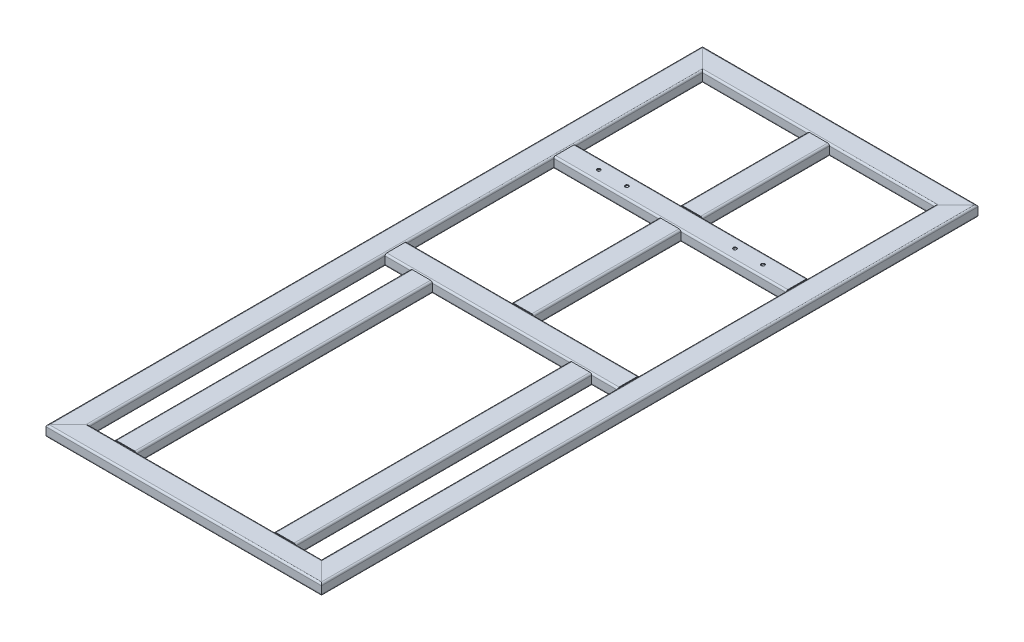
from build123d import *

# Parameters (mm, degrees)
TUBO_RETTANGOLARE_80_X_40_X_3_0_1_DEPTH      = 2395.72135955
TUBO_RETTANGOLARE_80_X_40_X_3_0_1_DEPTH_BACK = 45.72135955
TUBO_RETTANGOLARE_80_X_40_X_3_0_1_2_DEPTH    = 1031.4427191
TUBO_RETTANGOLARE_80_X_40_X_3_0_1_3_DEPTH    = 2441.4427191
TUBO_RETTANGOLARE_80_X_40_X_3_0_1_4_DEPTH    = 1031.4427191
TUBO_RETTANGOLARE_80_X_40_X_3_0_2_DEPTH      = 940
TUBO_RETTANGOLARE_80_X_40_X_3_0_2_2_DEPTH    = 940
TUBO_RETTANGOLARE_80_X_40_X_3_0_3_DEPTH      = 1175
TUBO_RETTANGOLARE_80_X_40_X_3_0_3_2_DEPTH    = 1175
TUBO_RETTANGOLARE_80_X_40_X_3_0_3_3_DEPTH    = 625
TUBO_RETTANGOLARE_80_X_40_X_3_0_3_4_DEPTH    = 550
SCHIZZO15_R                                  = 10
TAGLIO_ESTRUSIONE1_DEPTH                     = 1180
TAGLIO_ESTRUSIONE4_REACH                     = 1320.304
SCHIZZO18_R                                  = 6.5
TAGLIO_ESTRUSIONE3_DEPTH                     = 480
TAGLIO_ESTRUSIONE3_DEPTH_BACK                = 480
SCHIZZO17_R                                  = 10
SCHIZZO19_R                                  = 10
TAGLIO_ESTRUSIONE5_DEPTH                     = 1180
SCHIZZO20_R                                  = 15
TAGLIO_ESTRUSIONE6_DEPTH                     = 10


with BuildPart() as part:
    # Sketch128 → Tubo rettangolare 80 X 40 X 3.0_1 (new, two sides: drawn at the far end of the back side and taken through both)
    with BuildSketch(Plane(origin=(-470, 0, 1175), x_dir=(0, 1, 0), z_dir=(0, 0, -1)).offset(-TUBO_RETTANGOLARE_80_X_40_X_3_0_1_DEPTH_BACK)):
        with BuildLine():
            Line((-13.6, -40), (13.6, -40))
            ThreePointArc((13.6, -40), (18.1254834, -38.1254834), (20, -33.6))
            Line((20, -33.6), (20, 33.6))
            ThreePointArc((20, 33.6), (18.1254834, 38.1254834), (13.6, 40))
            Line((13.6, 40), (-13.6, 40))
            ThreePointArc((-13.6, 40), (-18.1254834, 38.1254834), (-20, 33.6))
            Line((-20, 33.6), (-20, -33.6))
            ThreePointArc((-20, -33.6), (-18.1254834, -38.1254834), (-13.6, -40))
        make_face()
        with BuildLine():
            Line((-13.6, -37), (13.6, -37))
            ThreePointArc((13.6, -37), (16.004163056, -36.004163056), (17, -33.6))
            Line((17, -33.6), (17, 33.6))
            ThreePointArc((17, 33.6), (16.004163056, 36.004163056), (13.6, 37))
            Line((13.6, 37), (-13.6, 37))
            ThreePointArc((-13.6, 37), (-16.004163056, 36.004163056), (-17, 33.6))
            Line((-17, 33.6), (-17, -33.6))
            ThreePointArc((-17, -33.6), (-16.004163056, -36.004163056), (-13.6, -37))
        make_face(mode=Mode.SUBTRACT)
    extrude(amount=TUBO_RETTANGOLARE_80_X_40_X_3_0_1_DEPTH + TUBO_RETTANGOLARE_80_X_40_X_3_0_1_DEPTH_BACK)

    # Tubo rettangolare 80 X 40 X 3.0_1 mitre
    split(bisect_by=Plane(origin=(-470, 0, 1175), x_dir=(0, -1, 0), z_dir=(-0.707106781, 0, -0.707106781)), keep=Keep.TOP)

    # Tubo rettangolare 80 X 40 X 3.0_1 mi 2
    split(bisect_by=Plane(origin=(-470, 0, -1175), x_dir=(0, -1, 0), z_dir=(-0.707106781, 0, 0.707106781)), keep=Keep.TOP)


with BuildPart() as body_2:
    # Sketch128 on segment 2 (on carried to segment 2) → Tubo rettangolare 80 X 40 X 3.0_1 2 (new body)
    with BuildSketch(Plane(origin=(-515.72135955, 0, -1175), x_dir=(0, 1, 0), z_dir=(1, 0, 0))):
        with BuildLine():
            Line((-13.6, -40), (13.6, -40))
            ThreePointArc((13.6, -40), (18.1254834, -38.1254834), (20, -33.6))
            Line((20, -33.6), (20, 33.6))
            ThreePointArc((20, 33.6), (18.1254834, 38.1254834), (13.6, 40))
            Line((13.6, 40), (-13.6, 40))
            ThreePointArc((-13.6, 40), (-18.1254834, 38.1254834), (-20, 33.6))
            Line((-20, 33.6), (-20, -33.6))
            ThreePointArc((-20, -33.6), (-18.1254834, -38.1254834), (-13.6, -40))
        make_face()
        with BuildLine():
            Line((-13.6, -37), (13.6, -37))
            ThreePointArc((13.6, -37), (16.004163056, -36.004163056), (17, -33.6))
            Line((17, -33.6), (17, 33.6))
            ThreePointArc((17, 33.6), (16.004163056, 36.004163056), (13.6, 37))
            Line((13.6, 37), (-13.6, 37))
            ThreePointArc((-13.6, 37), (-16.004163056, 36.004163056), (-17, 33.6))
            Line((-17, 33.6), (-17, -33.6))
            ThreePointArc((-17, -33.6), (-16.004163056, -36.004163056), (-13.6, -37))
        make_face(mode=Mode.SUBTRACT)
    extrude(amount=TUBO_RETTANGOLARE_80_X_40_X_3_0_1_2_DEPTH)

    # Tubo rettangolare 80 X 40 X 3.0_1 2 mitr
    split(bisect_by=Plane(origin=(470, 0, -1175), x_dir=(0, -1, 0), z_dir=(-0.707106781, 0, -0.707106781)), keep=Keep.TOP)

    # Tubo rettangolare 80 X 40 X 3.0_1 2  2
    split(bisect_by=Plane(origin=(-470, 0, -1175), x_dir=(0, 1, 0), z_dir=(0.707106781, 0, -0.707106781)), keep=Keep.TOP)


with BuildPart() as body_3:
    # Sketch128 on segment 3 (on carried to segment 3) → Tubo rettangolare 80 X 40 X 3.0_1 3 (new body)
    with BuildSketch(Plane(origin=(470, 0, -1220.72135955), x_dir=(0, 1, 0), z_dir=(0, 0, 1))):
        with BuildLine():
            Line((-13.6, -40), (13.6, -40))
            ThreePointArc((13.6, -40), (18.1254834, -38.1254834), (20, -33.6))
            Line((20, -33.6), (20, 33.6))
            ThreePointArc((20, 33.6), (18.1254834, 38.1254834), (13.6, 40))
            Line((13.6, 40), (-13.6, 40))
            ThreePointArc((-13.6, 40), (-18.1254834, 38.1254834), (-20, 33.6))
            Line((-20, 33.6), (-20, -33.6))
            ThreePointArc((-20, -33.6), (-18.1254834, -38.1254834), (-13.6, -40))
        make_face()
        with BuildLine():
            Line((-13.6, -37), (13.6, -37))
            ThreePointArc((13.6, -37), (16.004163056, -36.004163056), (17, -33.6))
            Line((17, -33.6), (17, 33.6))
            ThreePointArc((17, 33.6), (16.004163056, 36.004163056), (13.6, 37))
            Line((13.6, 37), (-13.6, 37))
            ThreePointArc((-13.6, 37), (-16.004163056, 36.004163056), (-17, 33.6))
            Line((-17, 33.6), (-17, -33.6))
            ThreePointArc((-17, -33.6), (-16.004163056, -36.004163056), (-13.6, -37))
        make_face(mode=Mode.SUBTRACT)
    extrude(amount=TUBO_RETTANGOLARE_80_X_40_X_3_0_1_3_DEPTH)

    # Tubo rettangolare 80 X 40 X 3.0_1 3 mitr
    split(bisect_by=Plane(origin=(470, 0, 1175), x_dir=(0, 1, 0), z_dir=(0.707106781, 0, -0.707106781)), keep=Keep.TOP)

    # Tubo rettangolare 80 X 40 X 3.0_1 3  2
    split(bisect_by=Plane(origin=(470, 0, -1175), x_dir=(0, 1, 0), z_dir=(0.707106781, 0, 0.707106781)), keep=Keep.TOP)


with BuildPart() as body_4:
    # Sketch128 on segment 4 (on carried to segment 4) → Tubo rettangolare 80 X 40 X 3.0_1 4 (new body)
    with BuildSketch(Plane(origin=(515.72135955, 0, 1175), x_dir=(0, 1, 0), z_dir=(-1, 0, 0))):
        with BuildLine():
            Line((-13.6, -40), (13.6, -40))
            ThreePointArc((13.6, -40), (18.1254834, -38.1254834), (20, -33.6))
            Line((20, -33.6), (20, 33.6))
            ThreePointArc((20, 33.6), (18.1254834, 38.1254834), (13.6, 40))
            Line((13.6, 40), (-13.6, 40))
            ThreePointArc((-13.6, 40), (-18.1254834, 38.1254834), (-20, 33.6))
            Line((-20, 33.6), (-20, -33.6))
            ThreePointArc((-20, -33.6), (-18.1254834, -38.1254834), (-13.6, -40))
        make_face()
        with BuildLine():
            Line((-13.6, -37), (13.6, -37))
            ThreePointArc((13.6, -37), (16.004163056, -36.004163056), (17, -33.6))
            Line((17, -33.6), (17, 33.6))
            ThreePointArc((17, 33.6), (16.004163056, 36.004163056), (13.6, 37))
            Line((13.6, 37), (-13.6, 37))
            ThreePointArc((-13.6, 37), (-16.004163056, 36.004163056), (-17, 33.6))
            Line((-17, 33.6), (-17, -33.6))
            ThreePointArc((-17, -33.6), (-16.004163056, -36.004163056), (-13.6, -37))
        make_face(mode=Mode.SUBTRACT)
    extrude(amount=TUBO_RETTANGOLARE_80_X_40_X_3_0_1_4_DEPTH)

    # Tubo rettangolare 80 X 40 X 3.0_1 4 mitr
    split(bisect_by=Plane(origin=(470, 0, 1175), x_dir=(0, -1, 0), z_dir=(-0.707106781, 0, 0.707106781)), keep=Keep.TOP)

    # Tubo rettangolare 80 X 40 X 3.0_1 4  2
    split(bisect_by=Plane(origin=(-470, 0, 1175), x_dir=(0, 1, 0), z_dir=(0.707106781, 0, 0.707106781)), keep=Keep.TOP)


with BuildPart() as body_5:
    # Sketch129 → Tubo rettangolare 80 X 40 X 3.0_2 (new body)
    with BuildSketch(Plane.YZ.offset(-470)):
        with BuildLine():
            Line((-13.6, -40), (13.6, -40))
            ThreePointArc((13.6, -40), (18.1254834, -38.1254834), (20, -33.6))
            Line((20, -33.6), (20, 33.6))
            ThreePointArc((20, 33.6), (18.1254834, 38.1254834), (13.6, 40))
            Line((13.6, 40), (-13.6, 40))
            ThreePointArc((-13.6, 40), (-18.1254834, 38.1254834), (-20, 33.6))
            Line((-20, 33.6), (-20, -33.6))
            ThreePointArc((-20, -33.6), (-18.1254834, -38.1254834), (-13.6, -40))
        make_face()
        with BuildLine():
            Line((-13.6, -37), (13.6, -37))
            ThreePointArc((13.6, -37), (16.004163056, -36.004163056), (17, -33.6))
            Line((17, -33.6), (17, 33.6))
            ThreePointArc((17, 33.6), (16.004163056, 36.004163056), (13.6, 37))
            Line((13.6, 37), (-13.6, 37))
            ThreePointArc((-13.6, 37), (-16.004163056, 36.004163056), (-17, 33.6))
            Line((-17, 33.6), (-17, -33.6))
            ThreePointArc((-17, -33.6), (-16.004163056, -36.004163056), (-13.6, -37))
        make_face(mode=Mode.SUBTRACT)
    extrude(amount=TUBO_RETTANGOLARE_80_X_40_X_3_0_2_DEPTH)

    # Accorcia_Estendi2 15
    split(bisect_by=Plane(origin=(430, 0, 0), x_dir=(0, -1, 0), z_dir=(-1, 0, 0)), keep=Keep.TOP)

    # Accorcia_Estendi2 60
    split(bisect_by=Plane.YZ.offset(-430), keep=Keep.TOP)


with BuildPart() as body_6:
    # Sketch129 on segment 2 (on carried to segment 2) → Tubo rettangolare 80 X 40 X 3.0_2 2 (new body)
    with BuildSketch(Plane(origin=(-470, 0, -625), x_dir=(0, 1, 0), z_dir=(1, 0, 0))):
        with BuildLine():
            Line((-13.6, -40), (13.6, -40))
            ThreePointArc((13.6, -40), (18.1254834, -38.1254834), (20, -33.6))
            Line((20, -33.6), (20, 33.6))
            ThreePointArc((20, 33.6), (18.1254834, 38.1254834), (13.6, 40))
            Line((13.6, 40), (-13.6, 40))
            ThreePointArc((-13.6, 40), (-18.1254834, 38.1254834), (-20, 33.6))
            Line((-20, 33.6), (-20, -33.6))
            ThreePointArc((-20, -33.6), (-18.1254834, -38.1254834), (-13.6, -40))
        make_face()
        with BuildLine():
            Line((-13.6, -37), (13.6, -37))
            ThreePointArc((13.6, -37), (16.004163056, -36.004163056), (17, -33.6))
            Line((17, -33.6), (17, 33.6))
            ThreePointArc((17, 33.6), (16.004163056, 36.004163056), (13.6, 37))
            Line((13.6, 37), (-13.6, 37))
            ThreePointArc((-13.6, 37), (-16.004163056, 36.004163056), (-17, 33.6))
            Line((-17, 33.6), (-17, -33.6))
            ThreePointArc((-17, -33.6), (-16.004163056, -36.004163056), (-13.6, -37))
        make_face(mode=Mode.SUBTRACT)
    extrude(amount=TUBO_RETTANGOLARE_80_X_40_X_3_0_2_2_DEPTH)

    # Accorcia_Estendi1 41
    split(bisect_by=Plane.YZ.offset(-430), keep=Keep.TOP)

    # Accorcia_Estendi1 60
    split(bisect_by=Plane(origin=(430, 0, 0), x_dir=(0, -1, 0), z_dir=(-1, 0, 0)), keep=Keep.TOP)

    # Taglio-Estrusione4: up to this face of the body (flat: up to its plane)
    taglio_estrusione4_end = Plane(body_6.part.faces().sort_by_distance((0, -20, -625))[0])
    # Schizzo18 → Taglio-Estrusione4 (cut, up to the picked face)
    with BuildSketch(Plane(origin=(0, 20, 0), x_dir=(1, 0, 0), z_dir=(0, 1, 0)), mode=Mode.PRIVATE) as taglio_estrusione4_sk1:
        with Locations(Location((303.95, 625, 0), (0, 0, 270))):
            Circle(SCHIZZO18_R)
    taglio_estrusione4_tool1 = split(extrude(taglio_estrusione4_sk1.sketch, amount=-TAGLIO_ESTRUSIONE4_REACH, mode=Mode.PRIVATE), bisect_by=taglio_estrusione4_end, keep=Keep.BOTH, mode=Mode.PRIVATE)
    # Schizzo18 → Taglio-Estrusione4 (cut, up to the picked face)
    with BuildSketch(Plane(origin=(0, 20, 0), x_dir=(1, 0, 0), z_dir=(0, 1, 0)), mode=Mode.PRIVATE) as taglio_estrusione4_sk2:
        with Locations(Location((200.05, 625, 0), (0, 0, 270))):
            Circle(SCHIZZO18_R)
    taglio_estrusione4_tool2 = split(extrude(taglio_estrusione4_sk2.sketch, amount=-TAGLIO_ESTRUSIONE4_REACH, mode=Mode.PRIVATE), bisect_by=taglio_estrusione4_end, keep=Keep.BOTH, mode=Mode.PRIVATE)
    # Schizzo18 → Taglio-Estrusione4 (cut, up to the picked face)
    with BuildSketch(Plane(origin=(0, 20, 0), x_dir=(1, 0, 0), z_dir=(0, 1, 0)), mode=Mode.PRIVATE) as taglio_estrusione4_sk3:
        with Locations(Location((-200.05, 625, 0), (0, 0, 270))):
            Circle(SCHIZZO18_R)
    taglio_estrusione4_tool3 = split(extrude(taglio_estrusione4_sk3.sketch, amount=-TAGLIO_ESTRUSIONE4_REACH, mode=Mode.PRIVATE), bisect_by=taglio_estrusione4_end, keep=Keep.BOTH, mode=Mode.PRIVATE)
    # Schizzo18 → Taglio-Estrusione4 (cut, up to the picked face)
    with BuildSketch(Plane(origin=(0, 20, 0), x_dir=(1, 0, 0), z_dir=(0, 1, 0)), mode=Mode.PRIVATE) as taglio_estrusione4_sk4:
        with Locations(Location((-303.95, 625, 0), (0, 0, 270))):
            Circle(SCHIZZO18_R)
    taglio_estrusione4_tool4 = split(extrude(taglio_estrusione4_sk4.sketch, amount=-TAGLIO_ESTRUSIONE4_REACH, mode=Mode.PRIVATE), bisect_by=taglio_estrusione4_end, keep=Keep.BOTH, mode=Mode.PRIVATE)
    add(taglio_estrusione4_tool1.solids().sort_by(Axis((303.95, 20, -625), (0, -1, 0)))[0], mode=Mode.SUBTRACT)
    add(taglio_estrusione4_tool2.solids().sort_by(Axis((200.05, 20, -625), (0, -1, 0)))[0], mode=Mode.SUBTRACT)
    add(taglio_estrusione4_tool3.solids().sort_by(Axis((-200.05, 20, -625), (0, -1, 0)))[0], mode=Mode.SUBTRACT)
    add(taglio_estrusione4_tool4.solids().sort_by(Axis((-303.95, 20, -625), (0, -1, 0)))[0], mode=Mode.SUBTRACT)

    # Schizzo20 → Taglio-Estrusione6 (cut)
    with BuildSketch(Plane.XZ.offset(20)):
        with Locations(Location((303.95, -625, 0), (0, 0, 270))):
            Circle(SCHIZZO20_R)
    taglio_estrusione6 = extrude(amount=-TAGLIO_ESTRUSIONE6_DEPTH, mode=Mode.SUBTRACT)

    # Ripetizione-Schizzo1: Taglio-Estrusione6 at 3 more places
    with Locations((-504, 0, 0), (-103.9, 0, 0), (-607.9, 0, 0)):
        add(taglio_estrusione6, mode=Mode.SUBTRACT)


with BuildPart() as body_7:
    # Sketch130 → Tubo rettangolare 80 X 40 X 3.0_3 (new body)
    with BuildSketch(Plane(origin=(-295, 0, 0), x_dir=(0, 1, 0), z_dir=(0, 0, 1))):
        with BuildLine():
            Line((-13.6, -40), (13.6, -40))
            ThreePointArc((13.6, -40), (18.1254834, -38.1254834), (20, -33.6))
            Line((20, -33.6), (20, 33.6))
            ThreePointArc((20, 33.6), (18.1254834, 38.1254834), (13.6, 40))
            Line((13.6, 40), (-13.6, 40))
            ThreePointArc((-13.6, 40), (-18.1254834, 38.1254834), (-20, 33.6))
            Line((-20, 33.6), (-20, -33.6))
            ThreePointArc((-20, -33.6), (-18.1254834, -38.1254834), (-13.6, -40))
        make_face()
        with BuildLine():
            Line((-13.6, -37), (13.6, -37))
            ThreePointArc((13.6, -37), (16.004163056, -36.004163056), (17, -33.6))
            Line((17, -33.6), (17, 33.6))
            ThreePointArc((17, 33.6), (16.004163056, 36.004163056), (13.6, 37))
            Line((13.6, 37), (-13.6, 37))
            ThreePointArc((-13.6, 37), (-16.004163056, 36.004163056), (-17, 33.6))
            Line((-17, 33.6), (-17, -33.6))
            ThreePointArc((-17, -33.6), (-16.004163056, -36.004163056), (-13.6, -37))
        make_face(mode=Mode.SUBTRACT)
    extrude(amount=TUBO_RETTANGOLARE_80_X_40_X_3_0_3_DEPTH)

    # Accorcia_Estendi4
    split(bisect_by=Plane(origin=(0, 0, 40), x_dir=(0, -1, 0), z_dir=(0, 0, 1)), keep=Keep.TOP)

    # Accorcia_Estendi4 3
    split(bisect_by=Plane.YX.offset(-1135), keep=Keep.TOP)


with BuildPart() as body_8:
    # Sketch130 on segment 2 (on carried to segment 2) → Tubo rettangolare 80 X 40 X 3.0_3 2 (new body)
    with BuildSketch(Plane(origin=(295, 0, 0), x_dir=(0, 1, 0), z_dir=(0, 0, 1))):
        with BuildLine():
            Line((-13.6, -40), (13.6, -40))
            ThreePointArc((13.6, -40), (18.1254834, -38.1254834), (20, -33.6))
            Line((20, -33.6), (20, 33.6))
            ThreePointArc((20, 33.6), (18.1254834, 38.1254834), (13.6, 40))
            Line((13.6, 40), (-13.6, 40))
            ThreePointArc((-13.6, 40), (-18.1254834, 38.1254834), (-20, 33.6))
            Line((-20, 33.6), (-20, -33.6))
            ThreePointArc((-20, -33.6), (-18.1254834, -38.1254834), (-13.6, -40))
        make_face()
        with BuildLine():
            Line((-13.6, -37), (13.6, -37))
            ThreePointArc((13.6, -37), (16.004163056, -36.004163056), (17, -33.6))
            Line((17, -33.6), (17, 33.6))
            ThreePointArc((17, 33.6), (16.004163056, 36.004163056), (13.6, 37))
            Line((13.6, 37), (-13.6, 37))
            ThreePointArc((-13.6, 37), (-16.004163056, 36.004163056), (-17, 33.6))
            Line((-17, 33.6), (-17, -33.6))
            ThreePointArc((-17, -33.6), (-16.004163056, -36.004163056), (-13.6, -37))
        make_face(mode=Mode.SUBTRACT)
    extrude(amount=TUBO_RETTANGOLARE_80_X_40_X_3_0_3_2_DEPTH)

    # Accorcia_Estendi4
    split(bisect_by=Plane(origin=(0, 0, 40), x_dir=(0, -1, 0), z_dir=(0, 0, 1)), keep=Keep.TOP)

    # Accorcia_Estendi4 3
    split(bisect_by=Plane.YX.offset(-1135), keep=Keep.TOP)


with BuildPart() as body_9:
    # Sketch130 on segment 3 (on carried to segment 3) → Tubo rettangolare 80 X 40 X 3.0_3 3 (new body)
    with BuildSketch(Plane(origin=(0, 0, -625), x_dir=(0, 1, 0), z_dir=(0, 0, 1))):
        with BuildLine():
            Line((-13.6, -40), (13.6, -40))
            ThreePointArc((13.6, -40), (18.1254834, -38.1254834), (20, -33.6))
            Line((20, -33.6), (20, 33.6))
            ThreePointArc((20, 33.6), (18.1254834, 38.1254834), (13.6, 40))
            Line((13.6, 40), (-13.6, 40))
            ThreePointArc((-13.6, 40), (-18.1254834, 38.1254834), (-20, 33.6))
            Line((-20, 33.6), (-20, -33.6))
            ThreePointArc((-20, -33.6), (-18.1254834, -38.1254834), (-13.6, -40))
        make_face()
        with BuildLine():
            Line((-13.6, -37), (13.6, -37))
            ThreePointArc((13.6, -37), (16.004163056, -36.004163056), (17, -33.6))
            Line((17, -33.6), (17, 33.6))
            ThreePointArc((17, 33.6), (16.004163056, 36.004163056), (13.6, 37))
            Line((13.6, 37), (-13.6, 37))
            ThreePointArc((-13.6, 37), (-16.004163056, 36.004163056), (-17, 33.6))
            Line((-17, 33.6), (-17, -33.6))
            ThreePointArc((-17, -33.6), (-16.004163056, -36.004163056), (-13.6, -37))
        make_face(mode=Mode.SUBTRACT)
    extrude(amount=TUBO_RETTANGOLARE_80_X_40_X_3_0_3_3_DEPTH)

    # Accorcia_Estendi3 11
    split(bisect_by=Plane(origin=(0, 0, -585), x_dir=(0, -1, 0), z_dir=(0, 0, 1)), keep=Keep.TOP)

    # Accorcia_Estendi3 54
    split(bisect_by=Plane.YX.offset(40), keep=Keep.TOP)


with BuildPart() as body_10:
    # Sketch130 on segment 4 (on carried to segment 4) → Tubo rettangolare 80 X 40 X 3.0_3 4 (new body)
    with BuildSketch(Plane(origin=(0, 0, -1175), x_dir=(0, 1, 0), z_dir=(0, 0, 1))):
        with BuildLine():
            Line((-13.6, -40), (13.6, -40))
            ThreePointArc((13.6, -40), (18.1254834, -38.1254834), (20, -33.6))
            Line((20, -33.6), (20, 33.6))
            ThreePointArc((20, 33.6), (18.1254834, 38.1254834), (13.6, 40))
            Line((13.6, 40), (-13.6, 40))
            ThreePointArc((-13.6, 40), (-18.1254834, 38.1254834), (-20, 33.6))
            Line((-20, 33.6), (-20, -33.6))
            ThreePointArc((-20, -33.6), (-18.1254834, -38.1254834), (-13.6, -40))
        make_face()
        with BuildLine():
            Line((-13.6, -37), (13.6, -37))
            ThreePointArc((13.6, -37), (16.004163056, -36.004163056), (17, -33.6))
            Line((17, -33.6), (17, 33.6))
            ThreePointArc((17, 33.6), (16.004163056, 36.004163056), (13.6, 37))
            Line((13.6, 37), (-13.6, 37))
            ThreePointArc((-13.6, 37), (-16.004163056, 36.004163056), (-17, 33.6))
            Line((-17, 33.6), (-17, -33.6))
            ThreePointArc((-17, -33.6), (-16.004163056, -36.004163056), (-13.6, -37))
        make_face(mode=Mode.SUBTRACT)
    extrude(amount=TUBO_RETTANGOLARE_80_X_40_X_3_0_3_4_DEPTH)

    # Accorcia_Estendi5
    split(bisect_by=Plane(origin=(0, 0, -1135), x_dir=(0, -1, 0), z_dir=(0, 0, 1)), keep=Keep.TOP)

    # Accorcia_Estendi5 3
    split(bisect_by=Plane.YX.offset(665), keep=Keep.TOP)


with BuildPart() as taglio_estrusione1_tool:
    # Schizzo15 → Taglio-Estrusione1 (new body)
    with BuildSketch(Plane.XY):
        with Locations(Location((0, 0, 0), (0, 0, 270))):
            Circle(SCHIZZO15_R)
    extrude(amount=-TAGLIO_ESTRUSIONE1_DEPTH)


with BuildPart() as body_2_1:
    add(body_2.part)

    # Taglio-Estrusione1: cut by taglio_estrusione1_tool
    add(taglio_estrusione1_tool.part, mode=Mode.SUBTRACT)


with BuildPart() as body_5_1:
    add(body_5.part)

    # Taglio-Estrusione1: cut by taglio_estrusione1_tool
    add(taglio_estrusione1_tool.part, mode=Mode.SUBTRACT)


with BuildPart() as taglio_estrusione3_tool:
    # Schizzo17 → Taglio-Estrusione3 (new, two sides: drawn at the far end of the back side and taken through both)
    with BuildSketch(Plane(origin=(0, 0, 0), x_dir=(0, 0, -1), z_dir=(1, 0, 0)).offset(-TAGLIO_ESTRUSIONE3_DEPTH_BACK)):
        with Locations(Location((0, 0, 0), (0, 0, 270))):
            Circle(SCHIZZO17_R)
        with Locations(Location((625, 0, 0), (0, 0, 270))):
            Circle(SCHIZZO17_R)
    extrude(amount=TAGLIO_ESTRUSIONE3_DEPTH + TAGLIO_ESTRUSIONE3_DEPTH_BACK)


with BuildPart() as part_1:
    add(part.part)

    # Taglio-Estrusione3: cut by taglio_estrusione3_tool
    add(taglio_estrusione3_tool.part, mode=Mode.SUBTRACT)


with BuildPart() as body_3_1:
    add(body_3.part)

    # Taglio-Estrusione3: cut by taglio_estrusione3_tool
    add(taglio_estrusione3_tool.part, mode=Mode.SUBTRACT)


with BuildPart() as taglio_estrusione5_tool:
    # Schizzo19 → Taglio-Estrusione5 (new body)
    with BuildSketch(Plane.XY):
        with Locations(Location((-295, 0, 0), (0, 0, 90))):
            Circle(SCHIZZO19_R)
        with Locations(Location((295, 0, 0), (0, 0, 90))):
            Circle(SCHIZZO19_R)
    extrude(amount=TAGLIO_ESTRUSIONE5_DEPTH)


with BuildPart() as body_4_1:
    add(body_4.part)

    # Taglio-Estrusione5: cut by taglio_estrusione5_tool
    add(taglio_estrusione5_tool.part, mode=Mode.SUBTRACT)


with BuildPart() as body_5_2:
    add(body_5_1.part)

    # Taglio-Estrusione5: cut by taglio_estrusione5_tool
    add(taglio_estrusione5_tool.part, mode=Mode.SUBTRACT)


solid = Compound([body_6.part, body_7.part, body_8.part, body_9.part, body_10.part, body_2_1.part, part_1.part, body_3_1.part, body_4_1.part, body_5_2.part])
